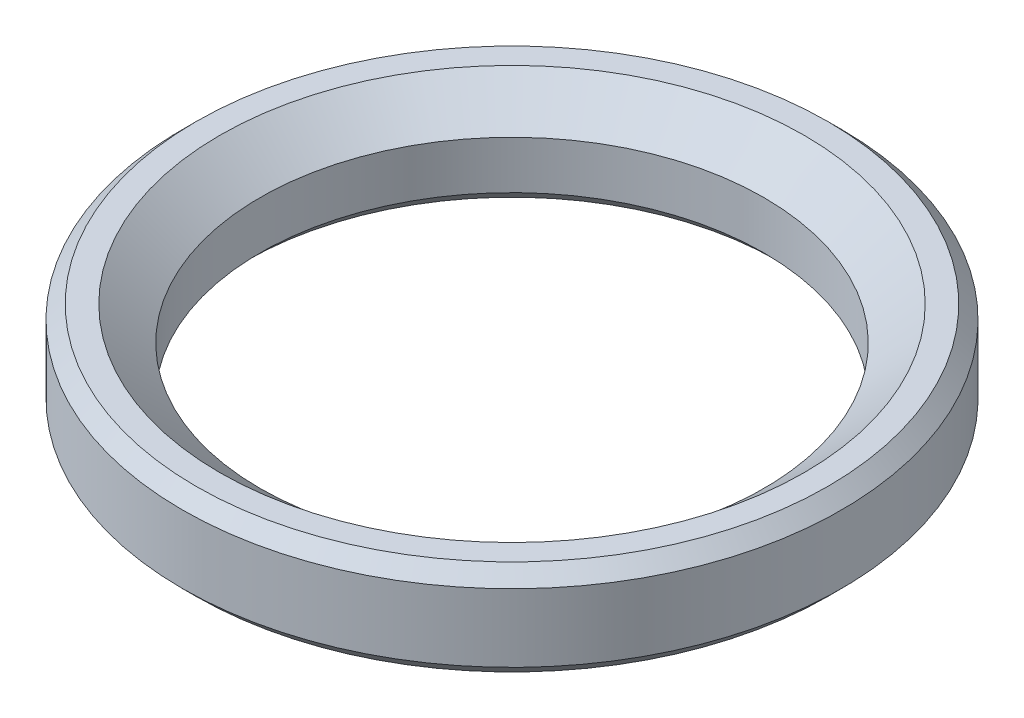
ISO-10303-21;
HEADER;
FILE_DESCRIPTION(('STEP AP214'),'2;1');
FILE_NAME('part.step','',(''),(''),'','','');
FILE_SCHEMA(('AUTOMOTIVE_DESIGN { 1 0 10303 214 1 1 1 1 }'));
ENDSEC;
DATA;
#1=APPLICATION_CONTEXT('core data for automotive mechanical design processes');
#2=APPLICATION_PROTOCOL_DEFINITION('international standard','automotive_design',2000,#1);
#3=PRODUCT_CONTEXT('',#1,'mechanical');
#4=PRODUCT('Part','Part','',(#3));
#5=PRODUCT_RELATED_PRODUCT_CATEGORY('part','',(#4));
#6=PRODUCT_DEFINITION_FORMATION('','',#4);
#7=PRODUCT_DEFINITION_CONTEXT('part definition',#1,'design');
#8=PRODUCT_DEFINITION('design','',#6,#7);
#9=PRODUCT_DEFINITION_SHAPE('','',#8);
#10=(LENGTH_UNIT() NAMED_UNIT(*) SI_UNIT(.MILLI.,.METRE.));
#11=(NAMED_UNIT(*) PLANE_ANGLE_UNIT() SI_UNIT($,.RADIAN.));
#12=(NAMED_UNIT(*) SI_UNIT($,.STERADIAN.) SOLID_ANGLE_UNIT());
#13=UNCERTAINTY_MEASURE_WITH_UNIT(LENGTH_MEASURE(1.E-05),#10,'distance_accuracy_value','');
#14=(GEOMETRIC_REPRESENTATION_CONTEXT(3) GLOBAL_UNCERTAINTY_ASSIGNED_CONTEXT((#13)) GLOBAL_UNIT_ASSIGNED_CONTEXT((#10,
#11,#12)) REPRESENTATION_CONTEXT('',''));
#15=CARTESIAN_POINT('',(0.,0.,0.));
#16=DIRECTION('',(0.,0.,1.));
#17=DIRECTION('',(1.,0.,0.));
#18=AXIS2_PLACEMENT_3D('',#15,#16,#17);
#19=CARTESIAN_POINT('',(0.,0.,0.));
#20=DIRECTION('',(0.,-1.,0.));
#21=DIRECTION('',(0.,0.,-1.));
#22=AXIS2_PLACEMENT_3D('',#19,#20,#21);
#23=CYLINDRICAL_SURFACE('',#22,9.25);
#24=CARTESIAN_POINT('',(0.,0.500000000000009,0.));
#25=DIRECTION('',(0.,-1.,0.));
#26=DIRECTION('',(0.,0.,-1.));
#27=AXIS2_PLACEMENT_3D('',#24,#25,#26);
#28=CIRCLE('',#27,9.25);
#29=CARTESIAN_POINT('',(0.,0.500000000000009,-9.25));
#30=VERTEX_POINT('',#29);
#31=EDGE_CURVE('E21',#30,#30,#28,.T.);
#32=ORIENTED_EDGE('',*,*,#31,.T.);
#33=EDGE_LOOP('',(#32));
#34=FACE_BOUND('',#33,.T.);
#35=CARTESIAN_POINT('',(0.,2.25961771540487,0.));
#36=DIRECTION('',(0.,-1.,0.));
#37=DIRECTION('',(0.,0.,-1.));
#38=AXIS2_PLACEMENT_3D('',#35,#36,#37);
#39=CIRCLE('',#38,9.25);
#40=CARTESIAN_POINT('',(0.,2.25961771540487,-9.25));
#41=VERTEX_POINT('',#40);
#42=EDGE_CURVE('E43',#41,#41,#39,.T.);
#43=ORIENTED_EDGE('',*,*,#42,.F.);
#44=EDGE_LOOP('',(#43));
#45=FACE_BOUND('',#44,.T.);
#46=ADVANCED_FACE('F14',(#34,#45),#23,.F.);
#47=CARTESIAN_POINT('',(9.25,0.,0.));
#48=DIRECTION('',(0.,-1.,0.));
#49=DIRECTION('',(0.,0.,-1.));
#50=AXIS2_PLACEMENT_3D('',#47,#48,#49);
#51=PLANE('',#50);
#52=CARTESIAN_POINT('',(0.,0.,0.));
#53=DIRECTION('',(0.,-1.,0.));
#54=DIRECTION('',(0.,0.,-1.));
#55=AXIS2_PLACEMENT_3D('',#52,#53,#54);
#56=CIRCLE('',#55,11.6);
#57=CARTESIAN_POINT('',(0.,0.,-11.6));
#58=VERTEX_POINT('',#57);
#59=EDGE_CURVE('E34',#58,#58,#56,.T.);
#60=ORIENTED_EDGE('',*,*,#59,.T.);
#61=EDGE_LOOP('',(#60));
#62=FACE_BOUND('',#61,.T.);
#63=CARTESIAN_POINT('',(0.,0.,0.));
#64=DIRECTION('',(0.,-1.,0.));
#65=DIRECTION('',(0.,0.,-1.));
#66=AXIS2_PLACEMENT_3D('',#63,#64,#65);
#67=CIRCLE('',#66,9.75);
#68=CARTESIAN_POINT('',(0.,0.,-9.75));
#69=VERTEX_POINT('',#68);
#70=EDGE_CURVE('E37',#69,#69,#67,.F.);
#71=ORIENTED_EDGE('',*,*,#70,.T.);
#72=EDGE_LOOP('',(#71));
#73=FACE_BOUND('',#72,.T.);
#74=ADVANCED_FACE('F51',(#62,#73),#51,.T.);
#75=CARTESIAN_POINT('',(0.,0.,0.));
#76=DIRECTION('',(0.,-1.,0.));
#77=DIRECTION('',(0.,0.,-1.));
#78=AXIS2_PLACEMENT_3D('',#75,#76,#77);
#79=CYLINDRICAL_SURFACE('',#78,12.1);
#80=CARTESIAN_POINT('',(0.,0.5,0.));
#81=DIRECTION('',(0.,-1.,0.));
#82=DIRECTION('',(0.,0.,-1.));
#83=AXIS2_PLACEMENT_3D('',#80,#81,#82);
#84=CIRCLE('',#83,12.1);
#85=CARTESIAN_POINT('',(0.,0.5,-12.1));
#86=VERTEX_POINT('',#85);
#87=EDGE_CURVE('E25',#86,#86,#84,.F.);
#88=ORIENTED_EDGE('',*,*,#87,.T.);
#89=EDGE_LOOP('',(#88));
#90=FACE_BOUND('',#89,.T.);
#91=CARTESIAN_POINT('',(0.,3.,0.));
#92=DIRECTION('',(0.,1.,0.));
#93=DIRECTION('',(0.,0.,1.));
#94=AXIS2_PLACEMENT_3D('',#91,#92,#93);
#95=CIRCLE('',#94,12.1);
#96=CARTESIAN_POINT('',(0.,3.,12.1));
#97=VERTEX_POINT('',#96);
#98=EDGE_CURVE('E29',#97,#97,#95,.F.);
#99=ORIENTED_EDGE('',*,*,#98,.T.);
#100=EDGE_LOOP('',(#99));
#101=FACE_BOUND('',#100,.T.);
#102=ADVANCED_FACE('F58',(#90,#101),#79,.T.);
#103=CARTESIAN_POINT('',(12.1,3.5,0.));
#104=DIRECTION('',(0.,1.,0.));
#105=DIRECTION('',(0.,0.,1.));
#106=AXIS2_PLACEMENT_3D('',#103,#104,#105);
#107=PLANE('',#106);
#108=CARTESIAN_POINT('',(0.,3.5,0.));
#109=DIRECTION('',(0.,1.,0.));
#110=DIRECTION('',(0.,0.,1.));
#111=AXIS2_PLACEMENT_3D('',#108,#109,#110);
#112=CIRCLE('',#111,11.6);
#113=CARTESIAN_POINT('',(0.,3.5,11.6));
#114=VERTEX_POINT('',#113);
#115=EDGE_CURVE('E10',#114,#114,#112,.T.);
#116=ORIENTED_EDGE('',*,*,#115,.T.);
#117=EDGE_LOOP('',(#116));
#118=FACE_BOUND('',#117,.T.);
#119=CARTESIAN_POINT('',(0.,3.5,0.));
#120=DIRECTION('',(0.,-1.,0.));
#121=DIRECTION('',(0.,0.,-1.));
#122=AXIS2_PLACEMENT_3D('',#119,#120,#121);
#123=CIRCLE('',#122,10.7282300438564);
#124=CARTESIAN_POINT('',(0.,3.5,-10.7282300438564));
#125=VERTEX_POINT('',#124);
#126=EDGE_CURVE('E40',#125,#125,#123,.T.);
#127=ORIENTED_EDGE('',*,*,#126,.T.);
#128=EDGE_LOOP('',(#127));
#129=FACE_BOUND('',#128,.T.);
#130=ADVANCED_FACE('F84',(#118,#129),#107,.T.);
#131=CARTESIAN_POINT('',(0.,3.5,0.));
#132=DIRECTION('',(0.,1.,0.));
#133=DIRECTION('',(0.,0.,1.));
#134=AXIS2_PLACEMENT_3D('',#131,#132,#133);
#135=CONICAL_SURFACE('',#134,10.7282300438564,0.872664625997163);
#136=ORIENTED_EDGE('',*,*,#42,.T.);
#137=EDGE_LOOP('',(#136));
#138=FACE_BOUND('',#137,.T.);
#139=ORIENTED_EDGE('',*,*,#126,.F.);
#140=EDGE_LOOP('',(#139));
#141=FACE_BOUND('',#140,.T.);
#142=ADVANCED_FACE('F47',(#138,#141),#135,.F.);
#143=CARTESIAN_POINT('',(0.,0.,0.));
#144=DIRECTION('',(0.,1.,0.));
#145=DIRECTION('',(0.,0.,1.));
#146=AXIS2_PLACEMENT_3D('',#143,#144,#145);
#147=CONICAL_SURFACE('',#146,11.6,0.785398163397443);
#148=ORIENTED_EDGE('',*,*,#87,.F.);
#149=EDGE_LOOP('',(#148));
#150=FACE_BOUND('',#149,.T.);
#151=ORIENTED_EDGE('',*,*,#59,.F.);
#152=EDGE_LOOP('',(#151));
#153=FACE_BOUND('',#152,.T.);
#154=ADVANCED_FACE('F63',(#150,#153),#147,.T.);
#155=CARTESIAN_POINT('',(0.,0.500000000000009,0.));
#156=DIRECTION('',(0.,-1.,0.));
#157=DIRECTION('',(0.,0.,-1.));
#158=AXIS2_PLACEMENT_3D('',#155,#156,#157);
#159=CONICAL_SURFACE('',#158,9.25,0.785398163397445);
#160=ORIENTED_EDGE('',*,*,#70,.F.);
#161=EDGE_LOOP('',(#160));
#162=FACE_BOUND('',#161,.T.);
#163=ORIENTED_EDGE('',*,*,#31,.F.);
#164=EDGE_LOOP('',(#163));
#165=FACE_BOUND('',#164,.T.);
#166=ADVANCED_FACE('F65',(#162,#165),#159,.F.);
#167=CARTESIAN_POINT('',(0.,3.,0.));
#168=DIRECTION('',(0.,-1.,0.));
#169=DIRECTION('',(0.,0.,-1.));
#170=AXIS2_PLACEMENT_3D('',#167,#168,#169);
#171=CONICAL_SURFACE('',#170,12.1,0.785398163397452);
#172=ORIENTED_EDGE('',*,*,#115,.F.);
#173=EDGE_LOOP('',(#172));
#174=FACE_BOUND('',#173,.T.);
#175=ORIENTED_EDGE('',*,*,#98,.F.);
#176=EDGE_LOOP('',(#175));
#177=FACE_BOUND('',#176,.T.);
#178=ADVANCED_FACE('F16',(#174,#177),#171,.T.);
#179=CLOSED_SHELL('',(#46,#74,#102,#130,#142,#154,#166,#178));
#180=MANIFOLD_SOLID_BREP('B1',#179);
#181=ADVANCED_BREP_SHAPE_REPRESENTATION('',(#18,#180),#14);
#182=SHAPE_DEFINITION_REPRESENTATION(#9,#181);
ENDSEC;
END-ISO-10303-21;
